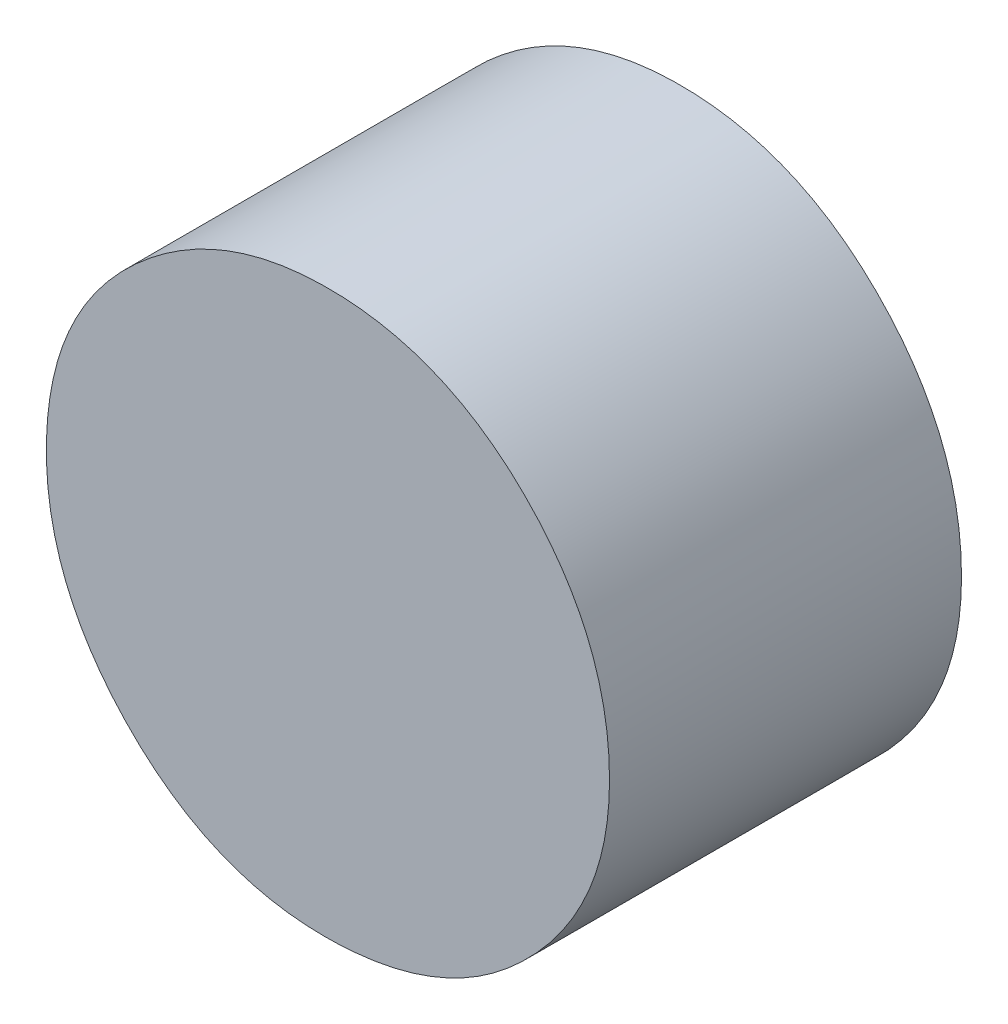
ISO-10303-21;
HEADER;
FILE_DESCRIPTION(('STEP AP214'),'2;1');
FILE_NAME('part.step','',(''),(''),'','','');
FILE_SCHEMA(('AUTOMOTIVE_DESIGN { 1 0 10303 214 1 1 1 1 }'));
ENDSEC;
DATA;
#1=APPLICATION_CONTEXT('core data for automotive mechanical design processes');
#2=APPLICATION_PROTOCOL_DEFINITION('international standard','automotive_design',2000,#1);
#3=PRODUCT_CONTEXT('',#1,'mechanical');
#4=PRODUCT('Part','Part','',(#3));
#5=PRODUCT_RELATED_PRODUCT_CATEGORY('part','',(#4));
#6=PRODUCT_DEFINITION_FORMATION('','',#4);
#7=PRODUCT_DEFINITION_CONTEXT('part definition',#1,'design');
#8=PRODUCT_DEFINITION('design','',#6,#7);
#9=PRODUCT_DEFINITION_SHAPE('','',#8);
#10=(LENGTH_UNIT() NAMED_UNIT(*) SI_UNIT(.MILLI.,.METRE.));
#11=(NAMED_UNIT(*) PLANE_ANGLE_UNIT() SI_UNIT($,.RADIAN.));
#12=(NAMED_UNIT(*) SI_UNIT($,.STERADIAN.) SOLID_ANGLE_UNIT());
#13=UNCERTAINTY_MEASURE_WITH_UNIT(LENGTH_MEASURE(1.E-05),#10,'distance_accuracy_value','');
#14=(GEOMETRIC_REPRESENTATION_CONTEXT(3) GLOBAL_UNCERTAINTY_ASSIGNED_CONTEXT((#13)) GLOBAL_UNIT_ASSIGNED_CONTEXT((#10,
#11,#12)) REPRESENTATION_CONTEXT('',''));
#15=CARTESIAN_POINT('',(0.,0.,0.));
#16=DIRECTION('',(0.,0.,1.));
#17=DIRECTION('',(1.,0.,0.));
#18=AXIS2_PLACEMENT_3D('',#15,#16,#17);
#19=CARTESIAN_POINT('',(48.7258798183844,3.12590165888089,0.500000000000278));
#20=CARTESIAN_POINT('',(48.5544512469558,3.12590165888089,0.500000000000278));
#21=CARTESIAN_POINT('',(48.4345972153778,3.2585061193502,0.500000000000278));
#22=CARTESIAN_POINT('',(48.3306417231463,3.37352070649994,0.500000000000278));
#23=CARTESIAN_POINT('',(48.3306417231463,3.52590165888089,0.500000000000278));
#24=CARTESIAN_POINT('',(48.3306417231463,3.70685403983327,0.500000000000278));
#25=CARTESIAN_POINT('',(48.4621572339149,3.82319468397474,0.500000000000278));
#26=CARTESIAN_POINT('',(48.5782607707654,3.92590165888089,0.500000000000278));
#27=CARTESIAN_POINT('',(48.7306417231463,3.92590165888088,0.500000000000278));
#28=CARTESIAN_POINT('',(48.9068321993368,3.92590165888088,0.500000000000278));
#29=CARTESIAN_POINT('',(49.0266862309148,3.79329719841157,0.500000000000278));
#30=CARTESIAN_POINT('',(49.1306417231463,3.67828261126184,0.500000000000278));
#31=CARTESIAN_POINT('',(49.1306417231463,3.52113975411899,0.500000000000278));
#32=CARTESIAN_POINT('',(49.1306417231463,3.34971118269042,0.500000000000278));
#33=CARTESIAN_POINT('',(48.9992161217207,3.2285934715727,0.500000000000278));
#34=CARTESIAN_POINT('',(48.8877845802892,3.12590165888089,0.500000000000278));
#35=CARTESIAN_POINT('',(48.7258798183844,3.12590165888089,0.500000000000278));
#36=B_SPLINE_CURVE_WITH_KNOTS('',2,(#19,#20,#21,#22,#23,#24,#25,#26,#27,#28,#29,#30,#31,#32,#33,
#34,#35),.UNSPECIFIED.,.T.,.F.,(3,2,2,2,2,2,2,2,3),(0.,1.,2.,3.,4.,5.,6.,7.,8.),.UNSPECIFIED.);
#37=DIRECTION('',(0.,0.,-1.));
#38=VECTOR('',#37,1.);
#39=SURFACE_OF_LINEAR_EXTRUSION('',#36,#38);
#40=CARTESIAN_POINT('',(48.7258798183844,3.12590165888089,0.500000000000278));
#41=VERTEX_POINT('',#40);
#42=EDGE_CURVE('E10',#41,#41,#36,.T.);
#43=ORIENTED_EDGE('',*,*,#42,.T.);
#44=EDGE_LOOP('',(#43));
#45=FACE_BOUND('',#44,.T.);
#46=CARTESIAN_POINT('',(48.7258798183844,3.12590165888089,2.77740241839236E-13));
#47=CARTESIAN_POINT('',(48.5544512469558,3.12590165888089,2.77719248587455E-13));
#48=CARTESIAN_POINT('',(48.4345972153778,3.2585061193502,2.77704571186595E-13));
#49=CARTESIAN_POINT('',(48.3306417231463,3.37352070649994,2.77691840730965E-13));
#50=CARTESIAN_POINT('',(48.3306417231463,3.52590165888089,2.77691840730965E-13));
#51=CARTESIAN_POINT('',(48.3306417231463,3.70685403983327,2.77691840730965E-13));
#52=CARTESIAN_POINT('',(48.4621572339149,3.82319468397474,2.77707946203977E-13));
#53=CARTESIAN_POINT('',(48.5782607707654,3.92590165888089,2.77722164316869E-13));
#54=CARTESIAN_POINT('',(48.7306417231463,3.92590165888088,2.77740824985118E-13));
#55=CARTESIAN_POINT('',(48.9068321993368,3.92590165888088,2.7776240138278E-13));
#56=CARTESIAN_POINT('',(49.0266862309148,3.79329719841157,2.77777078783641E-13));
#57=CARTESIAN_POINT('',(49.1306417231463,3.67828261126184,2.77789809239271E-13));
#58=CARTESIAN_POINT('',(49.1306417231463,3.52113975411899,2.77789809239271E-13));
#59=CARTESIAN_POINT('',(49.1306417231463,3.34971118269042,2.77789809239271E-13));
#60=CARTESIAN_POINT('',(48.9992161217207,3.2285934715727,2.77773714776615E-13));
#61=CARTESIAN_POINT('',(48.8877845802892,3.12590165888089,2.7776006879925E-13));
#62=CARTESIAN_POINT('',(48.7258798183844,3.12590165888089,2.77740241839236E-13));
#63=B_SPLINE_CURVE_WITH_KNOTS('',2,(#46,#47,#48,#49,#50,#51,#52,#53,#54,#55,#56,#57,#58,#59,#60,
#61,#62),.UNSPECIFIED.,.T.,.F.,(3,2,2,2,2,2,2,2,3),(0.,1.,2.,3.,4.,5.,6.,7.,8.),.UNSPECIFIED.);
#64=CARTESIAN_POINT('',(48.7258798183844,3.12590165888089,2.77740241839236E-13));
#65=VERTEX_POINT('',#64);
#66=EDGE_CURVE('E24',#65,#65,#63,.T.);
#67=ORIENTED_EDGE('',*,*,#66,.F.);
#68=EDGE_LOOP('',(#67));
#69=FACE_BOUND('',#68,.T.);
#70=ADVANCED_FACE('F14',(#45,#69),#39,.T.);
#71=CARTESIAN_POINT('',(48.7306417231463,3.92590165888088,0.500000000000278));
#72=DIRECTION('',(0.,0.,1.));
#73=DIRECTION('',(0.948007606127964,-0.318247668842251,0.));
#74=AXIS2_PLACEMENT_3D('',#71,#72,#73);
#75=PLANE('',#74);
#76=ORIENTED_EDGE('',*,*,#42,.F.);
#77=EDGE_LOOP('',(#76));
#78=FACE_BOUND('',#77,.T.);
#79=ADVANCED_FACE('F52',(#78),#75,.T.);
#80=CARTESIAN_POINT('',(48.7306417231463,3.92590165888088,2.77740824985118E-13));
#81=DIRECTION('',(0.,0.,1.));
#82=DIRECTION('',(0.948007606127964,-0.318247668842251,0.));
#83=AXIS2_PLACEMENT_3D('',#80,#81,#82);
#84=PLANE('',#83);
#85=ORIENTED_EDGE('',*,*,#66,.T.);
#86=EDGE_LOOP('',(#85));
#87=FACE_BOUND('',#86,.T.);
#88=ADVANCED_FACE('F49',(#87),#84,.F.);
#89=CLOSED_SHELL('',(#70,#79,#88));
#90=MANIFOLD_SOLID_BREP('B1',#89);
#91=ADVANCED_BREP_SHAPE_REPRESENTATION('',(#18,#90),#14);
#92=SHAPE_DEFINITION_REPRESENTATION(#9,#91);
ENDSEC;
END-ISO-10303-21;
